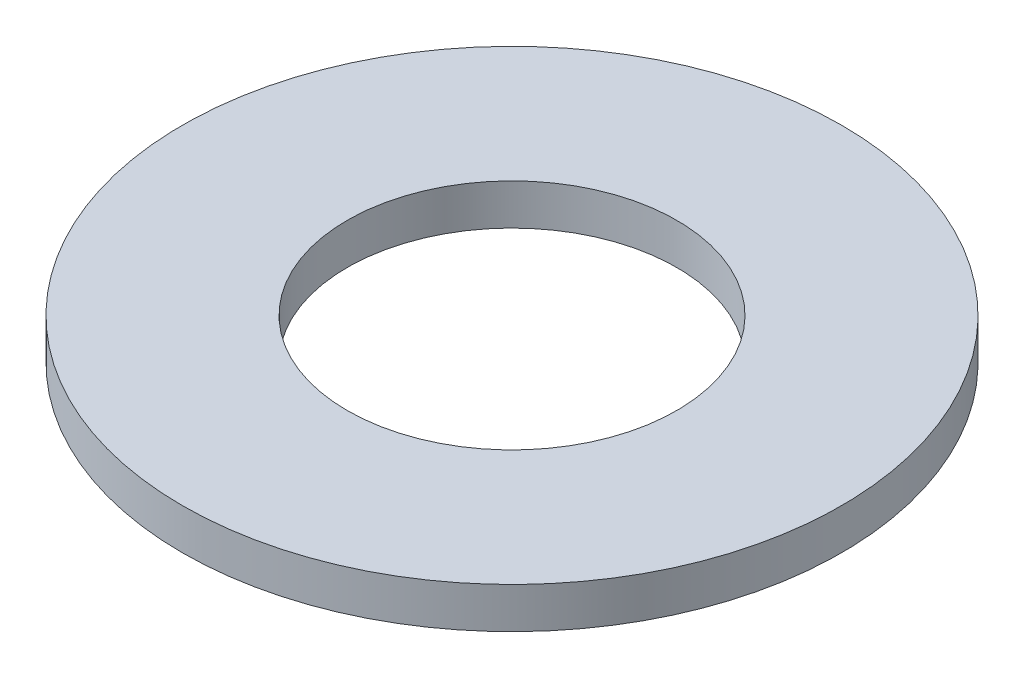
from build123d import *

# Parameters (mm, degrees)
SKETCH1_R           = 250
SKETCH1_R_2         = 125
BOSS_EXTRUDE1_DEPTH = 31


with BuildPart() as part:
    # Sketch1 → Boss-Extrude1 (new body)
    with BuildSketch(Plane(origin=(0, 0, 0), x_dir=(1, 0, 0), z_dir=(0, 1, 0))):
        with Locations(Location((0, 0, 0), (0, 0, 270))):
            Circle(SKETCH1_R)
        with Locations(Location((0, 0, 0), (0, 0, 270))):
            Circle(SKETCH1_R_2, mode=Mode.SUBTRACT)
    extrude(amount=BOSS_EXTRUDE1_DEPTH)


solid = part.part
